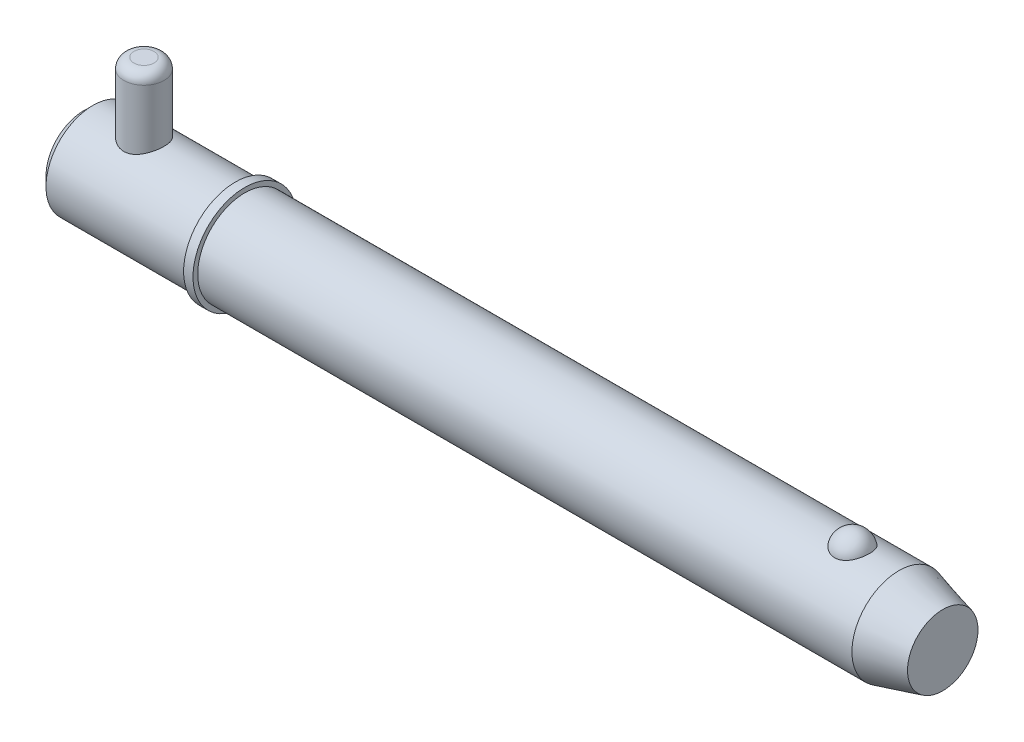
ISO-10303-21;
HEADER;
FILE_DESCRIPTION(('STEP AP214'),'2;1');
FILE_NAME('part.step','',(''),(''),'','','');
FILE_SCHEMA(('AUTOMOTIVE_DESIGN { 1 0 10303 214 1 1 1 1 }'));
ENDSEC;
DATA;
#1=APPLICATION_CONTEXT('core data for automotive mechanical design processes');
#2=APPLICATION_PROTOCOL_DEFINITION('international standard','automotive_design',2000,#1);
#3=PRODUCT_CONTEXT('',#1,'mechanical');
#4=PRODUCT('Part','Part','',(#3));
#5=PRODUCT_RELATED_PRODUCT_CATEGORY('part','',(#4));
#6=PRODUCT_DEFINITION_FORMATION('','',#4);
#7=PRODUCT_DEFINITION_CONTEXT('part definition',#1,'design');
#8=PRODUCT_DEFINITION('design','',#6,#7);
#9=PRODUCT_DEFINITION_SHAPE('','',#8);
#10=(LENGTH_UNIT() NAMED_UNIT(*) SI_UNIT(.MILLI.,.METRE.));
#11=(NAMED_UNIT(*) PLANE_ANGLE_UNIT() SI_UNIT($,.RADIAN.));
#12=(NAMED_UNIT(*) SI_UNIT($,.STERADIAN.) SOLID_ANGLE_UNIT());
#13=UNCERTAINTY_MEASURE_WITH_UNIT(LENGTH_MEASURE(1.E-05),#10,'distance_accuracy_value','');
#14=(GEOMETRIC_REPRESENTATION_CONTEXT(3) GLOBAL_UNCERTAINTY_ASSIGNED_CONTEXT((#13)) GLOBAL_UNIT_ASSIGNED_CONTEXT((#10,
#11,#12)) REPRESENTATION_CONTEXT('',''));
#15=CARTESIAN_POINT('',(0.,0.,0.));
#16=DIRECTION('',(0.,0.,1.));
#17=DIRECTION('',(1.,0.,0.));
#18=AXIS2_PLACEMENT_3D('',#15,#16,#17);
#19=CARTESIAN_POINT('',(14.28,26.985,0.));
#20=DIRECTION('',(0.,-1.,0.));
#21=DIRECTION('',(0.,0.,-1.));
#22=AXIS2_PLACEMENT_3D('',#19,#20,#21);
#23=CYLINDRICAL_SURFACE('',#22,4.76);
#24=CARTESIAN_POINT('',(14.28,-8.73500000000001,0.));
#25=DIRECTION('',(0.,1.,0.));
#26=DIRECTION('',(0.,0.,1.));
#27=AXIS2_PLACEMENT_3D('',#24,#25,#26);
#28=CIRCLE('',#27,4.76);
#29=CARTESIAN_POINT('',(14.28,-8.73500000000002,-4.76));
#30=VERTEX_POINT('',#29);
#31=EDGE_CURVE('P0_E25',#30,#30,#28,.T.);
#32=CARTESIAN_POINT('',(14.28,24.605,0.));
#33=DIRECTION('',(0.,1.,0.));
#34=DIRECTION('',(0.,0.,1.));
#35=AXIS2_PLACEMENT_3D('',#32,#33,#34);
#36=CIRCLE('',#35,4.76);
#37=CARTESIAN_POINT('',(14.28,24.605,-4.76));
#38=VERTEX_POINT('',#37);
#39=EDGE_CURVE('P0_E29',#38,#38,#36,.F.);
#40=CARTESIAN_POINT('',(14.28,-8.73500000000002,-4.76));
#41=CARTESIAN_POINT('',(14.28,-8.38770833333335,-4.76));
#42=CARTESIAN_POINT('',(14.28,-8.04041666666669,-4.76));
#43=CARTESIAN_POINT('',(14.28,-7.34583333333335,-4.76));
#44=CARTESIAN_POINT('',(14.28,-6.99854166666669,-4.76));
#45=CARTESIAN_POINT('',(14.28,-6.30395833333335,-4.76));
#46=CARTESIAN_POINT('',(14.28,-5.95666666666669,-4.76));
#47=CARTESIAN_POINT('',(14.28,-5.26208333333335,-4.76));
#48=CARTESIAN_POINT('',(14.28,-4.91479166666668,-4.76));
#49=CARTESIAN_POINT('',(14.28,-4.22020833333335,-4.76));
#50=CARTESIAN_POINT('',(14.28,-3.87291666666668,-4.76));
#51=CARTESIAN_POINT('',(14.28,-3.17833333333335,-4.76));
#52=CARTESIAN_POINT('',(14.28,-2.83104166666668,-4.76));
#53=CARTESIAN_POINT('',(14.28,-2.13645833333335,-4.76));
#54=CARTESIAN_POINT('',(14.28,-1.78916666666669,-4.76));
#55=CARTESIAN_POINT('',(14.28,-1.09458333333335,-4.76));
#56=CARTESIAN_POINT('',(14.28,-0.747291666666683,-4.76));
#57=CARTESIAN_POINT('',(14.28,-0.052708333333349,-4.76));
#58=CARTESIAN_POINT('',(14.28,0.294583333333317,-4.76));
#59=CARTESIAN_POINT('',(14.28,0.989166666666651,-4.76));
#60=CARTESIAN_POINT('',(14.28,1.33645833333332,-4.76));
#61=CARTESIAN_POINT('',(14.28,2.03104166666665,-4.76));
#62=CARTESIAN_POINT('',(14.28,2.37833333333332,-4.76));
#63=CARTESIAN_POINT('',(14.28,3.07291666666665,-4.76));
#64=CARTESIAN_POINT('',(14.28,3.42020833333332,-4.76));
#65=CARTESIAN_POINT('',(14.28,4.11479166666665,-4.76));
#66=CARTESIAN_POINT('',(14.28,4.46208333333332,-4.76));
#67=CARTESIAN_POINT('',(14.28,5.15666666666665,-4.76));
#68=CARTESIAN_POINT('',(14.28,5.50395833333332,-4.76));
#69=CARTESIAN_POINT('',(14.28,6.19854166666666,-4.76));
#70=CARTESIAN_POINT('',(14.28,6.54583333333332,-4.76));
#71=CARTESIAN_POINT('',(14.28,7.24041666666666,-4.76));
#72=CARTESIAN_POINT('',(14.28,7.58770833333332,-4.76));
#73=CARTESIAN_POINT('',(14.28,8.28229166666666,-4.76));
#74=CARTESIAN_POINT('',(14.28,8.62958333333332,-4.76));
#75=CARTESIAN_POINT('',(14.28,9.32416666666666,-4.76));
#76=CARTESIAN_POINT('',(14.28,9.67145833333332,-4.76));
#77=CARTESIAN_POINT('',(14.28,10.3660416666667,-4.76));
#78=CARTESIAN_POINT('',(14.28,10.7133333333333,-4.76));
#79=CARTESIAN_POINT('',(14.28,11.4079166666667,-4.76));
#80=CARTESIAN_POINT('',(14.28,11.7552083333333,-4.76));
#81=CARTESIAN_POINT('',(14.28,12.4497916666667,-4.76));
#82=CARTESIAN_POINT('',(14.28,12.7970833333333,-4.76));
#83=CARTESIAN_POINT('',(14.28,13.4916666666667,-4.76));
#84=CARTESIAN_POINT('',(14.28,13.8389583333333,-4.76));
#85=CARTESIAN_POINT('',(14.28,14.5335416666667,-4.76));
#86=CARTESIAN_POINT('',(14.28,14.8808333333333,-4.76));
#87=CARTESIAN_POINT('',(14.28,15.5754166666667,-4.76));
#88=CARTESIAN_POINT('',(14.28,15.9227083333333,-4.76));
#89=CARTESIAN_POINT('',(14.28,16.6172916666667,-4.76));
#90=CARTESIAN_POINT('',(14.28,16.9645833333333,-4.76));
#91=CARTESIAN_POINT('',(14.28,17.6591666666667,-4.76));
#92=CARTESIAN_POINT('',(14.28,18.0064583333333,-4.76));
#93=CARTESIAN_POINT('',(14.28,18.7010416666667,-4.76));
#94=CARTESIAN_POINT('',(14.28,19.0483333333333,-4.76));
#95=CARTESIAN_POINT('',(14.28,19.7429166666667,-4.76));
#96=CARTESIAN_POINT('',(14.28,20.0902083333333,-4.76));
#97=CARTESIAN_POINT('',(14.28,20.7847916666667,-4.76));
#98=CARTESIAN_POINT('',(14.28,21.1320833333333,-4.76));
#99=CARTESIAN_POINT('',(14.28,21.8266666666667,-4.76));
#100=CARTESIAN_POINT('',(14.28,22.1739583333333,-4.76));
#101=CARTESIAN_POINT('',(14.28,22.8685416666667,-4.76));
#102=CARTESIAN_POINT('',(14.28,23.2158333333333,-4.76));
#103=CARTESIAN_POINT('',(14.28,23.9104166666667,-4.76));
#104=CARTESIAN_POINT('',(14.28,24.2577083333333,-4.76));
#105=CARTESIAN_POINT('',(14.28,24.605,-4.76));
#106=B_SPLINE_CURVE_WITH_KNOTS('',3,(#40,#41,#42,#43,#44,#45,#46,#47,#48,#49,#50,#51,#52,#53,
#54,#55,#56,#57,#58,#59,#60,#61,#62,#63,#64,#65,#66,#67,#68,#69,#70,#71,#72,#73,#74,#75,#76,#77,
#78,#79,#80,#81,#82,#83,#84,#85,#86,#87,#88,#89,#90,#91,#92,#93,#94,#95,#96,#97,#98,#99,#100,
#101,#102,#103,#104,#105),.UNSPECIFIED.,.F.,.F.,(4,2,2,2,2,2,2,2,2,2,2,2,2,2,2,2,2,2,2,2,2,2,2,
2,2,2,2,2,2,2,2,2,4),(0.,1.041875,2.08375,3.125625,4.1675,5.209375,6.25125,7.293125,
8.33500000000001,9.376875,10.41875,11.460625,12.5025,13.544375,14.58625,15.628125,16.67,
17.711875,18.75375,19.795625,20.8375,21.879375,22.92125,23.963125,25.005,26.046875,27.08875,
28.130625,29.1725,30.214375,31.25625,32.298125,33.34),.UNSPECIFIED.);
#107=EDGE_CURVE('P0_BSEAM14',#30,#38,#106,.T.);
#108=ORIENTED_EDGE('',*,*,#31,.T.);
#109=ORIENTED_EDGE('',*,*,#39,.T.);
#110=ORIENTED_EDGE('',*,*,#107,.T.);
#111=ORIENTED_EDGE('',*,*,#107,.F.);
#112=EDGE_LOOP('',(#108,#110,#109,#111));
#113=FACE_BOUND('',#112,.T.);
#114=ADVANCED_FACE('P0_F14',(#113),#23,.T.);
#115=CARTESIAN_POINT('',(14.28,26.985,0.));
#116=DIRECTION('',(0.,1.,0.));
#117=DIRECTION('',(0.,0.,1.));
#118=AXIS2_PLACEMENT_3D('',#115,#116,#117);
#119=PLANE('',#118);
#120=CARTESIAN_POINT('',(14.28,26.985,0.));
#121=DIRECTION('',(0.,1.,0.));
#122=DIRECTION('',(0.,0.,1.));
#123=AXIS2_PLACEMENT_3D('',#120,#121,#122);
#124=CIRCLE('',#123,2.38);
#125=CARTESIAN_POINT('',(14.28,26.985,2.38));
#126=VERTEX_POINT('',#125);
#127=EDGE_CURVE('P0_E10',#126,#126,#124,.T.);
#128=ORIENTED_EDGE('',*,*,#127,.T.);
#129=EDGE_LOOP('',(#128));
#130=FACE_BOUND('',#129,.T.);
#131=ADVANCED_FACE('P0_F46',(#130),#119,.T.);
#132=CARTESIAN_POINT('',(14.28,-11.115,0.));
#133=DIRECTION('',(0.,1.,0.));
#134=DIRECTION('',(0.,0.,1.));
#135=AXIS2_PLACEMENT_3D('',#132,#133,#134);
#136=PLANE('',#135);
#137=CARTESIAN_POINT('',(14.28,-11.115,0.));
#138=DIRECTION('',(0.,1.,0.));
#139=DIRECTION('',(0.,0.,1.));
#140=AXIS2_PLACEMENT_3D('',#137,#138,#139);
#141=CIRCLE('',#140,2.38);
#142=CARTESIAN_POINT('',(14.28,-11.115,2.38));
#143=VERTEX_POINT('',#142);
#144=EDGE_CURVE('P0_E21',#143,#143,#141,.F.);
#145=ORIENTED_EDGE('',*,*,#144,.T.);
#146=EDGE_LOOP('',(#145));
#147=FACE_BOUND('',#146,.T.);
#148=ADVANCED_FACE('P0_F43',(#147),#136,.F.);
#149=CARTESIAN_POINT('',(14.28,-8.735,0.));
#150=DIRECTION('',(0.,1.,0.));
#151=DIRECTION('',(0.,0.,1.));
#152=AXIS2_PLACEMENT_3D('',#149,#150,#151);
#153=DEGENERATE_TOROIDAL_SURFACE('',#152,2.38,2.38,.T.);
#154=ORIENTED_EDGE('',*,*,#144,.F.);
#155=EDGE_LOOP('',(#154));
#156=FACE_BOUND('',#155,.T.);
#157=ORIENTED_EDGE('',*,*,#31,.F.);
#158=EDGE_LOOP('',(#157));
#159=FACE_BOUND('',#158,.T.);
#160=ADVANCED_FACE('P0_F38',(#156,#159),#153,.T.);
#161=CARTESIAN_POINT('',(14.28,24.605,0.));
#162=DIRECTION('',(0.,1.,0.));
#163=DIRECTION('',(0.,0.,1.));
#164=AXIS2_PLACEMENT_3D('',#161,#162,#163);
#165=DEGENERATE_TOROIDAL_SURFACE('',#164,2.38,2.38,.T.);
#166=ORIENTED_EDGE('',*,*,#39,.F.);
#167=EDGE_LOOP('',(#166));
#168=FACE_BOUND('',#167,.T.);
#169=ORIENTED_EDGE('',*,*,#127,.F.);
#170=EDGE_LOOP('',(#169));
#171=FACE_BOUND('',#170,.T.);
#172=ADVANCED_FACE('P0_F16',(#168,#171),#165,.T.);
#173=CLOSED_SHELL('',(#114,#131,#148,#160,#172));
#174=MANIFOLD_SOLID_BREP('P0_B1',#173);
#175=CARTESIAN_POINT('',(0.,0.,0.));
#176=DIRECTION('',(1.,0.,0.));
#177=DIRECTION('',(0.,0.,-1.));
#178=AXIS2_PLACEMENT_3D('',#175,#176,#177);
#179=CYLINDRICAL_SURFACE('',#178,11.115);
#180=CARTESIAN_POINT('',(192.829563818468,0.,0.));
#181=DIRECTION('',(1.,0.,0.));
#182=DIRECTION('',(0.,0.,-1.));
#183=AXIS2_PLACEMENT_3D('',#180,#181,#182);
#184=CIRCLE('',#183,11.115);
#185=CARTESIAN_POINT('',(192.829563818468,0.,-11.115));
#186=VERTEX_POINT('',#185);
#187=EDGE_CURVE('P1_E81',#186,#186,#184,.T.);
#188=ORIENTED_EDGE('',*,*,#187,.F.);
#189=EDGE_LOOP('',(#188));
#190=FACE_BOUND('',#189,.T.);
#191=CARTESIAN_POINT('',(38.1,0.,0.));
#192=DIRECTION('',(1.,0.,0.));
#193=DIRECTION('',(0.,0.,-1.));
#194=AXIS2_PLACEMENT_3D('',#191,#192,#193);
#195=CIRCLE('',#194,11.115);
#196=CARTESIAN_POINT('',(38.1,0.,-11.115));
#197=VERTEX_POINT('',#196);
#198=EDGE_CURVE('P1_E85',#197,#197,#195,.T.);
#199=ORIENTED_EDGE('',*,*,#198,.T.);
#200=EDGE_LOOP('',(#199));
#201=FACE_BOUND('',#200,.T.);
#202=CARTESIAN_POINT('',(181.831068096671,10.3028087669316,4.17077409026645));
#203=CARTESIAN_POINT('',(181.614775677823,10.3028003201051,4.17078240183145));
#204=CARTESIAN_POINT('',(181.398548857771,10.3098895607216,4.15340593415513));
#205=CARTESIAN_POINT('',(180.972540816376,10.3373834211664,4.08449540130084));
#206=CARTESIAN_POINT('',(180.762757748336,10.3577841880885,4.03297121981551));
#207=CARTESIAN_POINT('',(180.355782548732,10.4095237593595,3.89746513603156));
#208=CARTESIAN_POINT('',(180.158572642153,10.4408466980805,3.81353029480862));
#209=CARTESIAN_POINT('',(179.781338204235,10.5110236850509,3.61560339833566));
#210=CARTESIAN_POINT('',(179.601317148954,10.5498792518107,3.50160528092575));
#211=CARTESIAN_POINT('',(179.257684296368,10.6322884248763,3.24292464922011));
#212=CARTESIAN_POINT('',(179.094686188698,10.6759443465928,3.09746040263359));
#213=CARTESIAN_POINT('',(178.794591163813,10.7625291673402,2.7817192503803));
#214=CARTESIAN_POINT('',(178.657499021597,10.8054579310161,2.61143778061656));
#215=CARTESIAN_POINT('',(178.406408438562,10.8881935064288,2.24226695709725));
#216=CARTESIAN_POINT('',(178.293710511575,10.9277761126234,2.04244123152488));
#217=CARTESIAN_POINT('',(178.101777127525,10.997484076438,1.62578254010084));
#218=CARTESIAN_POINT('',(178.022544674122,11.0276085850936,1.40894804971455));
#219=CARTESIAN_POINT('',(177.898303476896,11.0756732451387,0.961250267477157));
#220=CARTESIAN_POINT('',(177.853760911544,11.0934470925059,0.73023943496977));
#221=CARTESIAN_POINT('',(177.801569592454,11.1143331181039,0.263439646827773));
#222=CARTESIAN_POINT('',(177.793920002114,11.1174456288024,0.0276507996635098));
#223=CARTESIAN_POINT('',(177.81561056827,11.1087161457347,-0.440729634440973));
#224=CARTESIAN_POINT('',(177.844762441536,11.0969502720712,-0.673331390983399));
#225=CARTESIAN_POINT('',(177.939143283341,11.0597872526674,-1.12996621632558));
#226=CARTESIAN_POINT('',(178.004372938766,11.0343898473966,-1.35399912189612));
#227=CARTESIAN_POINT('',(178.16969844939,10.972515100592,-1.78750286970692));
#228=CARTESIAN_POINT('',(178.26983863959,10.9360236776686,-1.99695478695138));
#229=CARTESIAN_POINT('',(178.502940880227,10.8557595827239,-2.39520667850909));
#230=CARTESIAN_POINT('',(178.635905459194,10.8119863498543,-2.58400506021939));
#231=CARTESIAN_POINT('',(178.932407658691,10.7216733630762,-2.93635726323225));
#232=CARTESIAN_POINT('',(179.096056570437,10.675123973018,-3.09981510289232));
#233=CARTESIAN_POINT('',(179.449860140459,10.5846571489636,-3.39592247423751));
#234=CARTESIAN_POINT('',(179.640012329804,10.5407394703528,-3.52857487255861));
#235=CARTESIAN_POINT('',(180.03750141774,10.4616690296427,-3.75646057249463));
#236=CARTESIAN_POINT('',(180.24436705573,10.4263443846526,-3.85245432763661));
#237=CARTESIAN_POINT('',(180.672954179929,10.3675574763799,-4.00798747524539));
#238=CARTESIAN_POINT('',(180.894670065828,10.344090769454,-4.0675405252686));
#239=CARTESIAN_POINT('',(181.334669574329,10.3128282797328,-4.14614314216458));
#240=CARTESIAN_POINT('',(181.552565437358,10.3043040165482,-4.1670783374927));
#241=CARTESIAN_POINT('',(181.98894951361,10.3016771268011,-4.17357158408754));
#242=CARTESIAN_POINT('',(182.207437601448,10.3075716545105,-4.15913661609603));
#243=CARTESIAN_POINT('',(182.631744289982,10.3326686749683,-4.09636961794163));
#244=CARTESIAN_POINT('',(182.837745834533,10.3514555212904,-4.0490957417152));
#245=CARTESIAN_POINT('',(183.238576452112,10.399818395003,-3.92320197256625));
#246=CARTESIAN_POINT('',(183.4334046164,10.4293952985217,-3.84457953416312));
#247=CARTESIAN_POINT('',(183.811191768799,10.4969600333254,-3.65612410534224));
#248=CARTESIAN_POINT('',(183.993797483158,10.5351178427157,-3.54564545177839));
#249=CARTESIAN_POINT('',(184.338204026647,10.6154999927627,-3.29718036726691));
#250=CARTESIAN_POINT('',(184.500000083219,10.657725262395,-3.15918764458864));
#251=CARTESIAN_POINT('',(184.806959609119,10.744212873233,-2.85163580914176));
#252=CARTESIAN_POINT('',(184.950891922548,10.7884718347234,-2.68084605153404));
#253=CARTESIAN_POINT('',(185.209237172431,10.872374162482,-2.31721864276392));
#254=CARTESIAN_POINT('',(185.323644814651,10.9120167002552,-2.12437704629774));
#255=CARTESIAN_POINT('',(185.523873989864,10.9838919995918,-1.71516999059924));
#256=CARTESIAN_POINT('',(185.60866178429,11.0158465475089,-1.49824866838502));
#257=CARTESIAN_POINT('',(185.74268382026,11.0673523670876,-1.05228572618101));
#258=CARTESIAN_POINT('',(185.791917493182,11.086903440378,-0.823243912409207));
#259=CARTESIAN_POINT('',(185.853891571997,11.1116323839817,-0.359087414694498));
#260=CARTESIAN_POINT('',(185.866566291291,11.1167843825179,-0.12396256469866));
#261=CARTESIAN_POINT('',(185.854973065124,11.1121144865,0.345220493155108));
#262=CARTESIAN_POINT('',(185.830705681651,11.1022928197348,0.579278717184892));
#263=CARTESIAN_POINT('',(185.745907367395,11.0687504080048,1.03866534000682));
#264=CARTESIAN_POINT('',(185.685529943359,11.0450885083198,1.26402641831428));
#265=CARTESIAN_POINT('',(185.529853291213,10.9863185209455,1.70076772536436));
#266=CARTESIAN_POINT('',(185.434551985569,10.9512097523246,1.91214712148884));
#267=CARTESIAN_POINT('',(185.210397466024,10.8729733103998,2.316083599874));
#268=CARTESIAN_POINT('',(185.081380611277,10.8298068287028,2.50854240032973));
#269=CARTESIAN_POINT('',(184.792732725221,10.7401896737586,2.86808766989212));
#270=CARTESIAN_POINT('',(184.633102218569,10.6937390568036,3.03517457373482));
#271=CARTESIAN_POINT('',(184.287534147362,10.6029321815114,3.33857581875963));
#272=CARTESIAN_POINT('',(184.101708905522,10.5585680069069,3.47501541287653));
#273=CARTESIAN_POINT('',(183.707875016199,10.4769321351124,3.71390897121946));
#274=CARTESIAN_POINT('',(183.499863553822,10.439661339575,3.81635861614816));
#275=CARTESIAN_POINT('',(183.054066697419,10.3749407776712,3.98910631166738));
#276=CARTESIAN_POINT('',(182.815234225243,10.3482457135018,4.05700929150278));
#277=CARTESIAN_POINT('',(182.327925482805,10.312188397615,4.14782844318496));
#278=CARTESIAN_POINT('',(182.079453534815,10.3028184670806,4.17076454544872));
#279=CARTESIAN_POINT('',(181.831068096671,10.3028087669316,4.17077409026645));
#280=B_SPLINE_CURVE_WITH_KNOTS('',3,(#202,#203,#204,#205,#206,#207,#208,#209,#210,#211,#212,
#213,#214,#215,#216,#217,#218,#219,#220,#221,#222,#223,#224,#225,#226,#227,#228,#229,#230,#231,
#232,#233,#234,#235,#236,#237,#238,#239,#240,#241,#242,#243,#244,#245,#246,#247,#248,#249,#250,
#251,#252,#253,#254,#255,#256,#257,#258,#259,#260,#261,#262,#263,#264,#265,#266,#267,#268,#269,
#270,#271,#272,#273,#274,#275,#276,#277,#278,#279),.UNSPECIFIED.,.T.,.F.,(4,2,2,2,2,2,2,2,2,2,2,
2,2,2,2,2,2,2,2,2,2,2,2,2,2,2,2,2,2,2,2,2,2,2,2,2,2,2,4),(0.,0.647966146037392,1.29574482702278,
1.9425864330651,2.58955857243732,3.25496465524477,3.92049326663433,4.61566368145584,
5.31089647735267,6.01531821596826,6.71972398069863,7.42054043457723,8.12137023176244,
8.82309331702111,9.5248704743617,10.2292439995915,10.9335519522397,11.6223330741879,
12.3108558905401,12.9647664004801,13.6185478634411,14.252184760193,14.8858731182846,
15.5334360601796,16.1811472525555,16.8611459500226,17.5412664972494,18.2431855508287,
18.9451158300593,19.6483065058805,20.3514864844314,21.0516982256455,21.7519516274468,
22.4556690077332,23.1593743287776,23.8601491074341,24.5610129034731,25.3054529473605,
26.049562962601),.UNSPECIFIED.);
#281=CARTESIAN_POINT('',(181.831068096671,10.3028087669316,4.17077409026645));
#282=VERTEX_POINT('',#281);
#283=EDGE_CURVE('P1_E35',#282,#282,#280,.T.);
#284=ORIENTED_EDGE('',*,*,#283,.T.);
#285=EDGE_LOOP('',(#284));
#286=FACE_BOUND('',#285,.T.);
#287=ADVANCED_FACE('P1_F13',(#190,#201,#286),#179,.T.);
#288=CARTESIAN_POINT('',(0.,0.,0.));
#289=DIRECTION('',(-1.,0.,0.));
#290=DIRECTION('',(0.,0.,1.));
#291=AXIS2_PLACEMENT_3D('',#288,#289,#290);
#292=PLANE('',#291);
#293=CARTESIAN_POINT('',(0.,0.,0.));
#294=DIRECTION('',(1.,0.,0.));
#295=DIRECTION('',(0.,0.,-1.));
#296=AXIS2_PLACEMENT_3D('',#293,#294,#295);
#297=CIRCLE('',#296,8.892);
#298=CARTESIAN_POINT('',(0.,0.,-8.892));
#299=VERTEX_POINT('',#298);
#300=EDGE_CURVE('P1_E9',#299,#299,#297,.T.);
#301=ORIENTED_EDGE('',*,*,#300,.F.);
#302=EDGE_LOOP('',(#301));
#303=FACE_BOUND('',#302,.T.);
#304=ADVANCED_FACE('P1_F15',(#303),#292,.T.);
#305=CARTESIAN_POINT('',(2.22299999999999,0.,0.));
#306=DIRECTION('',(1.,0.,0.));
#307=DIRECTION('',(0.,0.,-1.));
#308=AXIS2_PLACEMENT_3D('',#305,#306,#307);
#309=CONICAL_SURFACE('',#308,11.115,0.78539816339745);
#310=ORIENTED_EDGE('',*,*,#300,.T.);
#311=EDGE_LOOP('',(#310));
#312=FACE_BOUND('',#311,.T.);
#313=CARTESIAN_POINT('',(2.22299999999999,0.,0.));
#314=DIRECTION('',(1.,0.,0.));
#315=DIRECTION('',(0.,0.,-1.));
#316=AXIS2_PLACEMENT_3D('',#313,#314,#315);
#317=CIRCLE('',#316,11.115);
#318=CARTESIAN_POINT('',(2.22299999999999,0.,-11.115));
#319=VERTEX_POINT('',#318);
#320=EDGE_CURVE('P1_E26',#319,#319,#317,.T.);
#321=ORIENTED_EDGE('',*,*,#320,.F.);
#322=EDGE_LOOP('',(#321));
#323=FACE_BOUND('',#322,.T.);
#324=ADVANCED_FACE('P1_F77',(#312,#323),#309,.T.);
#325=CARTESIAN_POINT('',(0.,0.,0.));
#326=DIRECTION('',(1.,0.,0.));
#327=DIRECTION('',(0.,0.,-1.));
#328=AXIS2_PLACEMENT_3D('',#325,#326,#327);
#329=CYLINDRICAL_SURFACE('',#328,11.115);
#330=CARTESIAN_POINT('',(14.28,-10.0441836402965,4.76));
#331=CARTESIAN_POINT('',(14.1533731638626,-10.0441846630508,4.75999904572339));
#332=CARTESIAN_POINT('',(14.0267055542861,-10.0465865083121,4.75493985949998));
#333=CARTESIAN_POINT('',(13.774298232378,-10.0561141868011,4.73475585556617));
#334=CARTESIAN_POINT('',(13.6485591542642,-10.0632429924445,4.71962470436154));
#335=CARTESIAN_POINT('',(13.3987500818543,-10.0819979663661,4.67942666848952));
#336=CARTESIAN_POINT('',(13.2746840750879,-10.0936334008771,4.65433930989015));
#337=CARTESIAN_POINT('',(13.0293244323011,-10.1210146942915,4.59449317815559));
#338=CARTESIAN_POINT('',(12.9080319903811,-10.1367622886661,4.55973032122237));
#339=CARTESIAN_POINT('',(12.669614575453,-10.1717810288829,4.48106435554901));
#340=CARTESIAN_POINT('',(12.5524727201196,-10.1910352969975,4.4372048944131));
#341=CARTESIAN_POINT('',(12.3224300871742,-10.2325403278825,4.34063417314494));
#342=CARTESIAN_POINT('',(12.2095309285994,-10.2547922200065,4.28791957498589));
#343=CARTESIAN_POINT('',(11.8782785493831,-10.3250879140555,4.11715127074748));
#344=CARTESIAN_POINT('',(11.6670799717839,-10.3767168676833,3.98637638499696));
#345=CARTESIAN_POINT('',(11.2564039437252,-10.4874309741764,3.68567149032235));
#346=CARTESIAN_POINT('',(11.0583793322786,-10.5467772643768,3.51386978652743));
#347=CARTESIAN_POINT('',(10.6927724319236,-10.6641377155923,3.13969960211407));
#348=CARTESIAN_POINT('',(10.5252022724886,-10.7221513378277,2.93731900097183));
#349=CARTESIAN_POINT('',(10.2965609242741,-10.8050020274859,2.60935726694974));
#350=CARTESIAN_POINT('',(10.2227768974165,-10.8324811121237,2.49310321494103));
#351=CARTESIAN_POINT('',(10.0853380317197,-10.884703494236,2.25418999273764));
#352=CARTESIAN_POINT('',(10.0216789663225,-10.9094479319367,2.13153352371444));
#353=CARTESIAN_POINT('',(9.90506238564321,-10.9554932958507,1.88060370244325));
#354=CARTESIAN_POINT('',(9.85210574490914,-10.9767939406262,1.7523298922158));
#355=CARTESIAN_POINT('',(9.75746464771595,-11.0153112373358,1.49115740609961));
#356=CARTESIAN_POINT('',(9.71577447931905,-11.0325299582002,1.35826111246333));
#357=CARTESIAN_POINT('',(9.64605475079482,-11.0615607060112,1.09614539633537));
#358=CARTESIAN_POINT('',(9.61740732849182,-11.0736151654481,0.96711700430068));
#359=CARTESIAN_POINT('',(9.57092026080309,-11.0932687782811,0.706847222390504));
#360=CARTESIAN_POINT('',(9.55307574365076,-11.1008699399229,0.575606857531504));
#361=CARTESIAN_POINT('',(9.52838640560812,-11.1114054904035,0.31192917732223));
#362=CARTESIAN_POINT('',(9.52153986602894,-11.114340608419,0.179492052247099));
#363=CARTESIAN_POINT('',(9.51892405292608,-11.1154607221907,-0.0855090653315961));
#364=CARTESIAN_POINT('',(9.52315432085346,-11.1136459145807,-0.218073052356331));
#365=CARTESIAN_POINT('',(9.542009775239,-11.1055891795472,-0.473709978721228));
#366=CARTESIAN_POINT('',(9.55594693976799,-11.099640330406,-0.596843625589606));
#367=CARTESIAN_POINT('',(9.59332832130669,-11.0837823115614,-0.841440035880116));
#368=CARTESIAN_POINT('',(9.61677567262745,-11.0738718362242,-0.962902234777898));
#369=CARTESIAN_POINT('',(9.67294089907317,-11.0503378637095,-1.20325684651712));
#370=CARTESIAN_POINT('',(9.70565569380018,-11.0367156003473,-1.32215009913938));
#371=CARTESIAN_POINT('',(9.78005008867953,-11.0060908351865,-1.55666640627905));
#372=CARTESIAN_POINT('',(9.82173311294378,-10.9890870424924,-1.67228819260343));
#373=CARTESIAN_POINT('',(9.96110379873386,-10.9330280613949,-2.01656166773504));
#374=CARTESIAN_POINT('',(10.0722987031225,-10.8892801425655,-2.23915547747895));
#375=CARTESIAN_POINT('',(10.3268588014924,-10.7934745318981,-2.66299199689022));
#376=CARTESIAN_POINT('',(10.4702355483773,-10.7414138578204,-2.86422700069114));
#377=CARTESIAN_POINT('',(10.7973904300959,-10.6296201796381,-3.25557775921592));
#378=CARTESIAN_POINT('',(10.9833705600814,-10.569604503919,-3.443774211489));
#379=CARTESIAN_POINT('',(11.3844486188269,-10.4514707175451,-3.78722133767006));
#380=CARTESIAN_POINT('',(11.5995590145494,-10.3933534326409,-3.94245783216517));
#381=CARTESIAN_POINT('',(11.9444340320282,-10.311516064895,-4.14990014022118));
#382=CARTESIAN_POINT('',(12.0654579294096,-10.2847012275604,-4.21573894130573));
#383=CARTESIAN_POINT('',(12.3132718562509,-10.2342051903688,-4.33688518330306));
#384=CARTESIAN_POINT('',(12.4400593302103,-10.2105226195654,-4.39219723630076));
#385=CARTESIAN_POINT('',(12.6985418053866,-10.1671237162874,-4.49174500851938));
#386=CARTESIAN_POINT('',(12.8302359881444,-10.1474067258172,-4.53598256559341));
#387=CARTESIAN_POINT('',(13.0975061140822,-10.1126841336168,-4.61287629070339));
#388=CARTESIAN_POINT('',(13.233079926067,-10.0976759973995,-4.64553869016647));
#389=CARTESIAN_POINT('',(13.4978553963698,-10.0737863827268,-4.6971059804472));
#390=CARTESIAN_POINT('',(13.6268754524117,-10.0645618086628,-4.716785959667));
#391=CARTESIAN_POINT('',(13.8862990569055,-10.051062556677,-4.74548419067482));
#392=CARTESIAN_POINT('',(14.0167019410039,-10.0467856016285,-4.75450734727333));
#393=CARTESIAN_POINT('',(14.277859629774,-10.0433352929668,-4.76179143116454));
#394=CARTESIAN_POINT('',(14.4086143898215,-10.0441613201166,-4.76005366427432));
#395=CARTESIAN_POINT('',(14.6694025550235,-10.0508838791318,-4.74584231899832));
#396=CARTESIAN_POINT('',(14.7994359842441,-10.0567802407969,-4.73336910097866));
#397=CARTESIAN_POINT('',(15.0487369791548,-10.0728449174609,-4.69907984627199));
#398=CARTESIAN_POINT('',(15.1681238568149,-10.0826872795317,-4.67797462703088));
#399=CARTESIAN_POINT('',(15.4045894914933,-10.1062580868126,-4.62682977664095));
#400=CARTESIAN_POINT('',(15.5216674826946,-10.1199877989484,-4.59678723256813));
#401=CARTESIAN_POINT('',(15.868278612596,-10.1664161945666,-4.49365911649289));
#402=CARTESIAN_POINT('',(16.0933756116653,-10.2043671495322,-4.40754694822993));
#403=CARTESIAN_POINT('',(16.5357981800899,-10.2919879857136,-4.19898201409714));
#404=CARTESIAN_POINT('',(16.7523611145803,-10.3420954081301,-4.07511281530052));
#405=CARTESIAN_POINT('',(17.1627188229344,-10.4477911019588,-3.7959429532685));
#406=CARTESIAN_POINT('',(17.3565033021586,-10.5033818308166,-3.64062816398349));
#407=CARTESIAN_POINT('',(17.7334034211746,-10.6196376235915,-3.28693729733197));
#408=CARTESIAN_POINT('',(17.9141276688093,-10.6803237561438,-3.08599175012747));
#409=CARTESIAN_POINT('',(18.1582189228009,-10.7666348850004,-2.76320365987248));
#410=CARTESIAN_POINT('',(18.2351223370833,-10.7946346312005,-2.65197124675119));
#411=CARTESIAN_POINT('',(18.3793967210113,-10.8483267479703,-2.42297927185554));
#412=CARTESIAN_POINT('',(18.4467718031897,-10.87402011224,-2.30522255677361));
#413=CARTESIAN_POINT('',(18.5717669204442,-10.9225249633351,-2.06324665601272));
#414=CARTESIAN_POINT('',(18.6293326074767,-10.9453202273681,-1.93899615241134));
#415=CARTESIAN_POINT('',(18.73370006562,-10.9872100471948,-1.6855059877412));
#416=CARTESIAN_POINT('',(18.7805065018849,-11.0063062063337,-1.55626851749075));
#417=CARTESIAN_POINT('',(18.8628731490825,-11.0402419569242,-1.29375150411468));
#418=CARTESIAN_POINT('',(18.8984366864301,-11.0550828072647,-1.16047316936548));
#419=CARTESIAN_POINT('',(18.9579183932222,-11.0800638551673,-0.890912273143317));
#420=CARTESIAN_POINT('',(18.9818374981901,-11.0902044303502,-0.75462995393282));
#421=CARTESIAN_POINT('',(19.0164177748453,-11.104911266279,-0.490295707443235));
#422=CARTESIAN_POINT('',(19.027922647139,-11.1098318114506,-0.362373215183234));
#423=CARTESIAN_POINT('',(19.040554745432,-11.1152360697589,-0.105876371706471));
#424=CARTESIAN_POINT('',(19.0416784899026,-11.1157182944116,0.0226981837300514));
#425=CARTESIAN_POINT('',(19.0335275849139,-11.1122291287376,0.27938352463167));
#426=CARTESIAN_POINT('',(19.0242587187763,-11.1082602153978,0.407494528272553));
#427=CARTESIAN_POINT('',(18.9954320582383,-11.0959792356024,0.662388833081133));
#428=CARTESIAN_POINT('',(18.9758704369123,-11.0876655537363,0.789171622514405));
#429=CARTESIAN_POINT('',(18.9276379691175,-11.0673259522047,1.03545890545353));
#430=CARTESIAN_POINT('',(18.8993573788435,-11.0554596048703,1.15505309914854));
#431=CARTESIAN_POINT('',(18.8337694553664,-11.0282166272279,1.39134516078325));
#432=CARTESIAN_POINT('',(18.7964589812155,-11.0128387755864,1.5080420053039));
#433=CARTESIAN_POINT('',(18.671464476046,-10.9619666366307,1.85262797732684));
#434=CARTESIAN_POINT('',(18.5706772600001,-10.9217161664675,2.07521484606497));
#435=CARTESIAN_POINT('',(18.33202463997,-10.8301378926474,2.51061719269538));
#436=CARTESIAN_POINT('',(18.1926775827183,-10.7783885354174,2.72252375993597));
#437=CARTESIAN_POINT('',(17.8829747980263,-10.669863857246,3.12088015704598));
#438=CARTESIAN_POINT('',(17.7126068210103,-10.6130865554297,3.30731987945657));
#439=CARTESIAN_POINT('',(17.3310036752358,-10.495668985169,3.66358491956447));
#440=CARTESIAN_POINT('',(17.1177010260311,-10.4350471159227,3.83122543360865));
#441=CARTESIAN_POINT('',(16.7778915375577,-10.3495418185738,4.05420569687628));
#442=CARTESIAN_POINT('',(16.6612023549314,-10.3219229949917,4.12383380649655));
#443=CARTESIAN_POINT('',(16.4218466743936,-10.2693487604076,4.25306463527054));
#444=CARTESIAN_POINT('',(16.2991829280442,-10.2443921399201,4.31267191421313));
#445=CARTESIAN_POINT('',(16.0488008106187,-10.1979981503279,4.42126071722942));
#446=CARTESIAN_POINT('',(15.9210894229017,-10.1765561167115,4.47025635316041));
#447=CARTESIAN_POINT('',(15.6613937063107,-10.1379191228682,4.55720152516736));
#448=CARTESIAN_POINT('',(15.5294115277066,-10.1207220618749,4.59515652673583));
#449=CARTESIAN_POINT('',(15.2624981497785,-10.091252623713,4.65951684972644));
#450=CARTESIAN_POINT('',(15.1275757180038,-10.0789672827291,4.68595259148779));
#451=CARTESIAN_POINT('',(14.8556442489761,-10.0597530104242,4.72706206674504));
#452=CARTESIAN_POINT('',(14.7186368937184,-10.0528199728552,4.74174481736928));
#453=CARTESIAN_POINT('',(14.5310955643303,-10.047196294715,4.75363843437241));
#454=CARTESIAN_POINT('',(14.48091543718,-10.0460674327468,4.75602323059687));
#455=CARTESIAN_POINT('',(14.3804923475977,-10.044560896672,4.7592042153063));
#456=CARTESIAN_POINT('',(14.3302493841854,-10.0441832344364,4.76000037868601));
#457=CARTESIAN_POINT('',(14.28,-10.0441836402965,4.76));
#458=B_SPLINE_CURVE_WITH_KNOTS('',3,(#330,#331,#332,#333,#334,#335,#336,#337,#338,#339,#340,
#341,#342,#343,#344,#345,#346,#347,#348,#349,#350,#351,#352,#353,#354,#355,#356,#357,#358,#359,
#360,#361,#362,#363,#364,#365,#366,#367,#368,#369,#370,#371,#372,#373,#374,#375,#376,#377,#378,
#379,#380,#381,#382,#383,#384,#385,#386,#387,#388,#389,#390,#391,#392,#393,#394,#395,#396,#397,
#398,#399,#400,#401,#402,#403,#404,#405,#406,#407,#408,#409,#410,#411,#412,#413,#414,#415,#416,
#417,#418,#419,#420,#421,#422,#423,#424,#425,#426,#427,#428,#429,#430,#431,#432,#433,#434,#435,
#436,#437,#438,#439,#440,#441,#442,#443,#444,#445,#446,#447,#448,#449,#450,#451,#452,#453,#454,
#455,#456,#457),.UNSPECIFIED.,.T.,.F.,(4,2,2,2,2,2,2,2,2,2,2,2,2,2,2,2,2,2,2,2,2,2,2,2,2,2,2,2,
2,2,2,2,2,2,2,2,2,2,2,2,2,2,2,2,2,2,2,2,2,2,2,2,2,2,2,2,2,2,2,2,2,2,2,4),(0.,0.379828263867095,
0.759895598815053,1.14074858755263,1.52176256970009,1.90098898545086,2.28035867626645,
3.03818035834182,3.84125131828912,4.6446414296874,5.06541657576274,5.48601561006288,
5.90664899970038,6.3270687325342,6.72470503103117,7.12216187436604,7.51955659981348,
7.91693487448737,8.28868404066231,8.66055582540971,9.03230414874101,9.40419465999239,
10.1585834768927,10.9132435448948,11.7236471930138,12.5343987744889,12.9550196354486,
13.3754557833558,13.7958221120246,14.2159617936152,14.6079540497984,14.9997658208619,
15.3915300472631,15.7832811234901,16.1477615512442,16.512360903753,17.240999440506,
18.0012974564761,18.761937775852,19.5886929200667,20.0025782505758,20.4162843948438,
20.832212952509,21.2479608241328,21.6635855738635,22.0791769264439,22.4642880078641,
22.8495282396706,23.2345541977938,23.6197234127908,23.9896813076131,24.3597680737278,
25.099327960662,25.8726239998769,26.6462260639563,27.4759193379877,27.8914891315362,
28.3068693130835,28.7216936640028,29.1363123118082,29.5498292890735,29.9630287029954,
30.113753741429,30.2644811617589),.UNSPECIFIED.);
#459=CARTESIAN_POINT('',(14.28,-10.0441836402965,4.76));
#460=VERTEX_POINT('',#459);
#461=EDGE_CURVE('P1_E17',#460,#460,#458,.T.);
#462=ORIENTED_EDGE('',*,*,#461,.F.);
#463=EDGE_LOOP('',(#462));
#464=FACE_BOUND('',#463,.T.);
#465=CARTESIAN_POINT('',(14.28,10.0441836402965,4.76));
#466=CARTESIAN_POINT('',(14.4066268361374,10.0441846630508,4.75999904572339));
#467=CARTESIAN_POINT('',(14.5332944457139,10.0465865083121,4.75493985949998));
#468=CARTESIAN_POINT('',(14.785701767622,10.0561141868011,4.73475585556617));
#469=CARTESIAN_POINT('',(14.9114408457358,10.0632429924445,4.71962470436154));
#470=CARTESIAN_POINT('',(15.1612499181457,10.0819979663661,4.67942666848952));
#471=CARTESIAN_POINT('',(15.2853159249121,10.0936334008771,4.65433930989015));
#472=CARTESIAN_POINT('',(15.5306755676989,10.1210146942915,4.59449317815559));
#473=CARTESIAN_POINT('',(15.6519680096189,10.1367622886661,4.55973032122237));
#474=CARTESIAN_POINT('',(15.890385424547,10.1717810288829,4.48106435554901));
#475=CARTESIAN_POINT('',(16.0075272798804,10.1910352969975,4.4372048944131));
#476=CARTESIAN_POINT('',(16.2375699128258,10.2325403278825,4.34063417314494));
#477=CARTESIAN_POINT('',(16.3504690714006,10.2547922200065,4.28791957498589));
#478=CARTESIAN_POINT('',(16.6817214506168,10.3250879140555,4.11715127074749));
#479=CARTESIAN_POINT('',(16.8929200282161,10.3767168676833,3.98637638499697));
#480=CARTESIAN_POINT('',(17.3035960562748,10.4874309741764,3.68567149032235));
#481=CARTESIAN_POINT('',(17.5016206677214,10.5467772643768,3.51386978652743));
#482=CARTESIAN_POINT('',(17.8672275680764,10.6641377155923,3.13969960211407));
#483=CARTESIAN_POINT('',(18.0347977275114,10.7221513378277,2.93731900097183));
#484=CARTESIAN_POINT('',(18.2634390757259,10.8050020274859,2.60935726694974));
#485=CARTESIAN_POINT('',(18.3372231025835,10.8324811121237,2.49310321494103));
#486=CARTESIAN_POINT('',(18.4746619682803,10.884703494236,2.25418999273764));
#487=CARTESIAN_POINT('',(18.5383210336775,10.9094479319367,2.13153352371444));
#488=CARTESIAN_POINT('',(18.6549376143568,10.9554932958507,1.88060370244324));
#489=CARTESIAN_POINT('',(18.7078942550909,10.9767939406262,1.75232989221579));
#490=CARTESIAN_POINT('',(18.8025353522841,11.0153112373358,1.4911574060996));
#491=CARTESIAN_POINT('',(18.844225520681,11.0325299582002,1.35826111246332));
#492=CARTESIAN_POINT('',(18.9139452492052,11.0615607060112,1.09614539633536));
#493=CARTESIAN_POINT('',(18.9425926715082,11.0736151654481,0.967117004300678));
#494=CARTESIAN_POINT('',(18.9890797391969,11.0932687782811,0.706847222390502));
#495=CARTESIAN_POINT('',(19.0069242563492,11.1008699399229,0.575606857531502));
#496=CARTESIAN_POINT('',(19.0316135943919,11.1114054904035,0.311929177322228));
#497=CARTESIAN_POINT('',(19.0384601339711,11.114340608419,0.179492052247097));
#498=CARTESIAN_POINT('',(19.0410759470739,11.1154607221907,-0.0855090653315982));
#499=CARTESIAN_POINT('',(19.0368456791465,11.1136459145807,-0.218073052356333));
#500=CARTESIAN_POINT('',(19.017990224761,11.1055891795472,-0.47370997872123));
#501=CARTESIAN_POINT('',(19.004053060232,11.099640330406,-0.596843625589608));
#502=CARTESIAN_POINT('',(18.9666716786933,11.0837823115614,-0.841440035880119));
#503=CARTESIAN_POINT('',(18.9432243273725,11.0738718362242,-0.9629022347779));
#504=CARTESIAN_POINT('',(18.8870591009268,11.0503378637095,-1.20325684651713));
#505=CARTESIAN_POINT('',(18.8543443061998,11.0367156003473,-1.32215009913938));
#506=CARTESIAN_POINT('',(18.7799499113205,11.0060908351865,-1.55666640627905));
#507=CARTESIAN_POINT('',(18.7382668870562,10.9890870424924,-1.67228819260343));
#508=CARTESIAN_POINT('',(18.5988962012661,10.9330280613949,-2.01656166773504));
#509=CARTESIAN_POINT('',(18.4877012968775,10.8892801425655,-2.23915547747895));
#510=CARTESIAN_POINT('',(18.2331411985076,10.7934745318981,-2.66299199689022));
#511=CARTESIAN_POINT('',(18.0897644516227,10.7414138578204,-2.86422700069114));
#512=CARTESIAN_POINT('',(17.7626095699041,10.6296201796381,-3.25557775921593));
#513=CARTESIAN_POINT('',(17.5766294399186,10.569604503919,-3.443774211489));
#514=CARTESIAN_POINT('',(17.1755513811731,10.4514707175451,-3.78722133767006));
#515=CARTESIAN_POINT('',(16.9604409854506,10.3933534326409,-3.94245783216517));
#516=CARTESIAN_POINT('',(16.6155659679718,10.311516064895,-4.14990014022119));
#517=CARTESIAN_POINT('',(16.4945420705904,10.2847012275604,-4.21573894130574));
#518=CARTESIAN_POINT('',(16.2467281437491,10.2342051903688,-4.33688518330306));
#519=CARTESIAN_POINT('',(16.1199406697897,10.2105226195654,-4.39219723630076));
#520=CARTESIAN_POINT('',(15.8614581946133,10.1671237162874,-4.49174500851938));
#521=CARTESIAN_POINT('',(15.7297640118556,10.1474067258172,-4.53598256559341));
#522=CARTESIAN_POINT('',(15.4624938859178,10.1126841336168,-4.61287629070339));
#523=CARTESIAN_POINT('',(15.326920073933,10.0976759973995,-4.64553869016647));
#524=CARTESIAN_POINT('',(15.0621446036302,10.0737863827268,-4.6971059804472));
#525=CARTESIAN_POINT('',(14.9331245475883,10.0645618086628,-4.716785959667));
#526=CARTESIAN_POINT('',(14.6737009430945,10.051062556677,-4.74548419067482));
#527=CARTESIAN_POINT('',(14.543298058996,10.0467856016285,-4.75450734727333));
#528=CARTESIAN_POINT('',(14.2821403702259,10.0433352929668,-4.76179143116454));
#529=CARTESIAN_POINT('',(14.1513856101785,10.0441613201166,-4.76005366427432));
#530=CARTESIAN_POINT('',(13.8905974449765,10.0508838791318,-4.74584231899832));
#531=CARTESIAN_POINT('',(13.7605640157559,10.0567802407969,-4.73336910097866));
#532=CARTESIAN_POINT('',(13.5112630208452,10.0728449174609,-4.69907984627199));
#533=CARTESIAN_POINT('',(13.3918761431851,10.0826872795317,-4.67797462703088));
#534=CARTESIAN_POINT('',(13.1554105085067,10.1062580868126,-4.62682977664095));
#535=CARTESIAN_POINT('',(13.0383325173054,10.1199877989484,-4.59678723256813));
#536=CARTESIAN_POINT('',(12.691721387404,10.1664161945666,-4.49365911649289));
#537=CARTESIAN_POINT('',(12.4666243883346,10.2043671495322,-4.40754694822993));
#538=CARTESIAN_POINT('',(12.0242018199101,10.2919879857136,-4.19898201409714));
#539=CARTESIAN_POINT('',(11.8076388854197,10.3420954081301,-4.07511281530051));
#540=CARTESIAN_POINT('',(11.3972811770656,10.4477911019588,-3.7959429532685));
#541=CARTESIAN_POINT('',(11.2034966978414,10.5033818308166,-3.64062816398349));
#542=CARTESIAN_POINT('',(10.8265965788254,10.6196376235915,-3.28693729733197));
#543=CARTESIAN_POINT('',(10.6458723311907,10.6803237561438,-3.08599175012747));
#544=CARTESIAN_POINT('',(10.4017810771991,10.7666348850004,-2.76320365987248));
#545=CARTESIAN_POINT('',(10.3248776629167,10.7946346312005,-2.65197124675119));
#546=CARTESIAN_POINT('',(10.1806032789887,10.8483267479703,-2.42297927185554));
#547=CARTESIAN_POINT('',(10.1132281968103,10.87402011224,-2.30522255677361));
#548=CARTESIAN_POINT('',(9.98823307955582,10.9225249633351,-2.06324665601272));
#549=CARTESIAN_POINT('',(9.93066739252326,10.9453202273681,-1.93899615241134));
#550=CARTESIAN_POINT('',(9.82629993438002,10.9872100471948,-1.6855059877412));
#551=CARTESIAN_POINT('',(9.77949349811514,11.0063062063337,-1.55626851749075));
#552=CARTESIAN_POINT('',(9.69712685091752,11.0402419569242,-1.29375150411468));
#553=CARTESIAN_POINT('',(9.66156331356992,11.0550828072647,-1.16047316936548));
#554=CARTESIAN_POINT('',(9.60208160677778,11.0800638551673,-0.890912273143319));
#555=CARTESIAN_POINT('',(9.57816250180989,11.0902044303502,-0.754629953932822));
#556=CARTESIAN_POINT('',(9.54358222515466,11.104911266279,-0.490295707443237));
#557=CARTESIAN_POINT('',(9.53207735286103,11.1098318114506,-0.362373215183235));
#558=CARTESIAN_POINT('',(9.51944525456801,11.1152360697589,-0.105876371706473));
#559=CARTESIAN_POINT('',(9.51832151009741,11.1157182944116,0.0226981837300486));
#560=CARTESIAN_POINT('',(9.52647241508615,11.1122291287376,0.279383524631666));
#561=CARTESIAN_POINT('',(9.53574128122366,11.1082602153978,0.407494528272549));
#562=CARTESIAN_POINT('',(9.5645679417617,11.0959792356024,0.662388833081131));
#563=CARTESIAN_POINT('',(9.58412956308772,11.0876655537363,0.789171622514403));
#564=CARTESIAN_POINT('',(9.63236203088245,11.0673259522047,1.03545890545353));
#565=CARTESIAN_POINT('',(9.66064262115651,11.0554596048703,1.15505309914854));
#566=CARTESIAN_POINT('',(9.72623054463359,11.0282166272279,1.39134516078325));
#567=CARTESIAN_POINT('',(9.76354101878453,11.0128387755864,1.5080420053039));
#568=CARTESIAN_POINT('',(9.88853552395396,10.9619666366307,1.85262797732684));
#569=CARTESIAN_POINT('',(9.98932273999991,10.9217161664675,2.07521484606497));
#570=CARTESIAN_POINT('',(10.22797536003,10.8301378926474,2.51061719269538));
#571=CARTESIAN_POINT('',(10.3673224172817,10.7783885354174,2.72252375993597));
#572=CARTESIAN_POINT('',(10.6770252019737,10.669863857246,3.12088015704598));
#573=CARTESIAN_POINT('',(10.8473931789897,10.6130865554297,3.30731987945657));
#574=CARTESIAN_POINT('',(11.2289963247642,10.495668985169,3.66358491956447));
#575=CARTESIAN_POINT('',(11.4422989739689,10.4350471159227,3.83122543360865));
#576=CARTESIAN_POINT('',(11.7821084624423,10.3495418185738,4.05420569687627));
#577=CARTESIAN_POINT('',(11.8987976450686,10.3219229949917,4.12383380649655));
#578=CARTESIAN_POINT('',(12.1381533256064,10.2693487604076,4.25306463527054));
#579=CARTESIAN_POINT('',(12.2608170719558,10.2443921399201,4.31267191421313));
#580=CARTESIAN_POINT('',(12.5111991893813,10.1979981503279,4.42126071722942));
#581=CARTESIAN_POINT('',(12.6389105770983,10.1765561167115,4.47025635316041));
#582=CARTESIAN_POINT('',(12.8986062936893,10.1379191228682,4.55720152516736));
#583=CARTESIAN_POINT('',(13.0305884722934,10.1207220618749,4.59515652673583));
#584=CARTESIAN_POINT('',(13.2975018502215,10.091252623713,4.65951684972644));
#585=CARTESIAN_POINT('',(13.4324242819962,10.0789672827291,4.68595259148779));
#586=CARTESIAN_POINT('',(13.7043557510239,10.0597530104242,4.72706206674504));
#587=CARTESIAN_POINT('',(13.8413631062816,10.0528199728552,4.74174481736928));
#588=CARTESIAN_POINT('',(14.0289044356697,10.047196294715,4.75363843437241));
#589=CARTESIAN_POINT('',(14.07908456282,10.0460674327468,4.75602323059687));
#590=CARTESIAN_POINT('',(14.1795076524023,10.044560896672,4.7592042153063));
#591=CARTESIAN_POINT('',(14.2297506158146,10.0441832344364,4.76000037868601));
#592=CARTESIAN_POINT('',(14.28,10.0441836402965,4.76));
#593=B_SPLINE_CURVE_WITH_KNOTS('',3,(#465,#466,#467,#468,#469,#470,#471,#472,#473,#474,#475,
#476,#477,#478,#479,#480,#481,#482,#483,#484,#485,#486,#487,#488,#489,#490,#491,#492,#493,#494,
#495,#496,#497,#498,#499,#500,#501,#502,#503,#504,#505,#506,#507,#508,#509,#510,#511,#512,#513,
#514,#515,#516,#517,#518,#519,#520,#521,#522,#523,#524,#525,#526,#527,#528,#529,#530,#531,#532,
#533,#534,#535,#536,#537,#538,#539,#540,#541,#542,#543,#544,#545,#546,#547,#548,#549,#550,#551,
#552,#553,#554,#555,#556,#557,#558,#559,#560,#561,#562,#563,#564,#565,#566,#567,#568,#569,#570,
#571,#572,#573,#574,#575,#576,#577,#578,#579,#580,#581,#582,#583,#584,#585,#586,#587,#588,#589,
#590,#591,#592),.UNSPECIFIED.,.T.,.F.,(4,2,2,2,2,2,2,2,2,2,2,2,2,2,2,2,2,2,2,2,2,2,2,2,2,2,2,2,
2,2,2,2,2,2,2,2,2,2,2,2,2,2,2,2,2,2,2,2,2,2,2,2,2,2,2,2,2,2,2,2,2,2,2,4),(0.,0.379828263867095,
0.759895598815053,1.14074858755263,1.52176256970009,1.90098898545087,2.28035867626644,
3.03818035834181,3.84125131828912,4.6446414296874,5.06541657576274,5.48601561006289,
5.90664899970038,6.3270687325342,6.72470503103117,7.12216187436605,7.51955659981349,
7.91693487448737,8.28868404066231,8.66055582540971,9.03230414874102,9.4041946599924,
10.1585834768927,10.9132435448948,11.7236471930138,12.5343987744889,12.9550196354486,
13.3754557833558,13.7958221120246,14.2159617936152,14.6079540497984,14.9997658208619,
15.3915300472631,15.7832811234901,16.1477615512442,16.512360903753,17.240999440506,
18.0012974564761,18.761937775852,19.5886929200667,20.0025782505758,20.4162843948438,
20.832212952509,21.2479608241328,21.6635855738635,22.0791769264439,22.4642880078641,
22.8495282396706,23.2345541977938,23.6197234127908,23.9896813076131,24.3597680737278,
25.099327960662,25.8726239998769,26.6462260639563,27.4759193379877,27.8914891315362,
28.3068693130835,28.7216936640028,29.1363123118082,29.5498292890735,29.9630287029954,
30.113753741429,30.2644811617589),.UNSPECIFIED.);
#594=CARTESIAN_POINT('',(14.28,10.0441836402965,4.76));
#595=VERTEX_POINT('',#594);
#596=EDGE_CURVE('P1_E43',#595,#595,#593,.T.);
#597=ORIENTED_EDGE('',*,*,#596,.F.);
#598=EDGE_LOOP('',(#597));
#599=FACE_BOUND('',#598,.T.);
#600=ORIENTED_EDGE('',*,*,#320,.T.);
#601=EDGE_LOOP('',(#600));
#602=FACE_BOUND('',#601,.T.);
#603=CARTESIAN_POINT('',(35.877,0.,0.));
#604=DIRECTION('',(1.,0.,0.));
#605=DIRECTION('',(0.,0.,-1.));
#606=AXIS2_PLACEMENT_3D('',#603,#604,#605);
#607=CIRCLE('',#606,11.115);
#608=CARTESIAN_POINT('',(35.877,0.,-11.115));
#609=VERTEX_POINT('',#608);
#610=EDGE_CURVE('P1_E31',#609,#609,#607,.T.);
#611=ORIENTED_EDGE('',*,*,#610,.F.);
#612=EDGE_LOOP('',(#611));
#613=FACE_BOUND('',#612,.T.);
#614=ADVANCED_FACE('P1_F103',(#464,#599,#602,#613),#329,.T.);
#615=CARTESIAN_POINT('',(35.877,11.115,0.));
#616=DIRECTION('',(-1.,0.,0.));
#617=DIRECTION('',(0.,0.,1.));
#618=AXIS2_PLACEMENT_3D('',#615,#616,#617);
#619=PLANE('',#618);
#620=ORIENTED_EDGE('',*,*,#610,.T.);
#621=EDGE_LOOP('',(#620));
#622=FACE_BOUND('',#621,.T.);
#623=CARTESIAN_POINT('',(35.877,0.,0.));
#624=DIRECTION('',(1.,0.,0.));
#625=DIRECTION('',(0.,0.,-1.));
#626=AXIS2_PLACEMENT_3D('',#623,#624,#625);
#627=CIRCLE('',#626,12.2265);
#628=CARTESIAN_POINT('',(35.877,0.,-12.2265));
#629=VERTEX_POINT('',#628);
#630=EDGE_CURVE('P1_E91',#629,#629,#627,.T.);
#631=ORIENTED_EDGE('',*,*,#630,.F.);
#632=EDGE_LOOP('',(#631));
#633=FACE_BOUND('',#632,.T.);
#634=ADVANCED_FACE('P1_F100',(#622,#633),#619,.T.);
#635=CARTESIAN_POINT('',(0.,0.,0.));
#636=DIRECTION('',(1.,0.,0.));
#637=DIRECTION('',(0.,0.,-1.));
#638=AXIS2_PLACEMENT_3D('',#635,#636,#637);
#639=CYLINDRICAL_SURFACE('',#638,12.2265);
#640=ORIENTED_EDGE('',*,*,#630,.T.);
#641=EDGE_LOOP('',(#640));
#642=FACE_BOUND('',#641,.T.);
#643=CARTESIAN_POINT('',(38.1,0.,0.));
#644=DIRECTION('',(1.,0.,0.));
#645=DIRECTION('',(0.,0.,-1.));
#646=AXIS2_PLACEMENT_3D('',#643,#644,#645);
#647=CIRCLE('',#646,12.2265);
#648=CARTESIAN_POINT('',(38.1,0.,-12.2265));
#649=VERTEX_POINT('',#648);
#650=EDGE_CURVE('P1_E88',#649,#649,#647,.T.);
#651=ORIENTED_EDGE('',*,*,#650,.F.);
#652=EDGE_LOOP('',(#651));
#653=FACE_BOUND('',#652,.T.);
#654=ADVANCED_FACE('P1_F68',(#642,#653),#639,.T.);
#655=CARTESIAN_POINT('',(38.1,12.2265,0.));
#656=DIRECTION('',(1.,0.,0.));
#657=DIRECTION('',(0.,0.,-1.));
#658=AXIS2_PLACEMENT_3D('',#655,#656,#657);
#659=PLANE('',#658);
#660=ORIENTED_EDGE('',*,*,#650,.T.);
#661=EDGE_LOOP('',(#660));
#662=FACE_BOUND('',#661,.T.);
#663=ORIENTED_EDGE('',*,*,#198,.F.);
#664=EDGE_LOOP('',(#663));
#665=FACE_BOUND('',#664,.T.);
#666=ADVANCED_FACE('P1_F62',(#662,#665),#659,.T.);
#667=CARTESIAN_POINT('',(203.2,0.,0.));
#668=DIRECTION('',(-1.,0.,0.));
#669=DIRECTION('',(0.,0.,1.));
#670=AXIS2_PLACEMENT_3D('',#667,#668,#669);
#671=CONICAL_SURFACE('',#670,8.33625000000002,0.26179938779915);
#672=ORIENTED_EDGE('',*,*,#187,.T.);
#673=EDGE_LOOP('',(#672));
#674=FACE_BOUND('',#673,.T.);
#675=CARTESIAN_POINT('',(203.2,0.,0.));
#676=DIRECTION('',(1.,0.,0.));
#677=DIRECTION('',(0.,0.,-1.));
#678=AXIS2_PLACEMENT_3D('',#675,#676,#677);
#679=CIRCLE('',#678,8.33625000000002);
#680=CARTESIAN_POINT('',(203.2,0.,-8.33625000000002));
#681=VERTEX_POINT('',#680);
#682=EDGE_CURVE('P1_E42',#681,#681,#679,.T.);
#683=ORIENTED_EDGE('',*,*,#682,.F.);
#684=EDGE_LOOP('',(#683));
#685=FACE_BOUND('',#684,.T.);
#686=ADVANCED_FACE('P1_F59',(#674,#685),#671,.T.);
#687=CARTESIAN_POINT('',(203.2,8.33625000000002,0.));
#688=DIRECTION('',(1.,0.,0.));
#689=DIRECTION('',(0.,0.,-1.));
#690=AXIS2_PLACEMENT_3D('',#687,#688,#689);
#691=PLANE('',#690);
#692=ORIENTED_EDGE('',*,*,#682,.T.);
#693=EDGE_LOOP('',(#692));
#694=FACE_BOUND('',#693,.T.);
#695=ADVANCED_FACE('P1_F55',(#694),#691,.T.);
#696=CARTESIAN_POINT('',(181.831068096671,10.0035,0.));
#697=DIRECTION('',(-1.,0.,0.));
#698=DIRECTION('',(0.,1.,0.));
#699=AXIS2_PLACEMENT_3D('',#696,#697,#698);
#700=SPHERICAL_SURFACE('',#699,4.18150000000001);
#701=ORIENTED_EDGE('',*,*,#283,.F.);
#702=EDGE_LOOP('',(#701));
#703=FACE_BOUND('',#702,.T.);
#704=ADVANCED_FACE('P1_F50',(#703),#700,.T.);
#705=CARTESIAN_POINT('',(14.28,-12.2265,0.));
#706=DIRECTION('',(0.,1.,0.));
#707=DIRECTION('',(0.,0.,1.));
#708=AXIS2_PLACEMENT_3D('',#705,#706,#707);
#709=CYLINDRICAL_SURFACE('',#708,4.76);
#710=ORIENTED_EDGE('',*,*,#461,.T.);
#711=EDGE_LOOP('',(#710));
#712=FACE_BOUND('',#711,.T.);
#713=ORIENTED_EDGE('',*,*,#596,.T.);
#714=EDGE_LOOP('',(#713));
#715=FACE_BOUND('',#714,.T.);
#716=ADVANCED_FACE('P1_F54',(#712,#715),#709,.F.);
#717=CLOSED_SHELL('',(#287,#304,#324,#614,#634,#654,#666,#686,#695,#704,#716));
#718=MANIFOLD_SOLID_BREP('P1_B1',#717);
#719=ADVANCED_BREP_SHAPE_REPRESENTATION('',(#18,#174,#718),#14);
#720=SHAPE_DEFINITION_REPRESENTATION(#9,#719);
ENDSEC;
END-ISO-10303-21;
